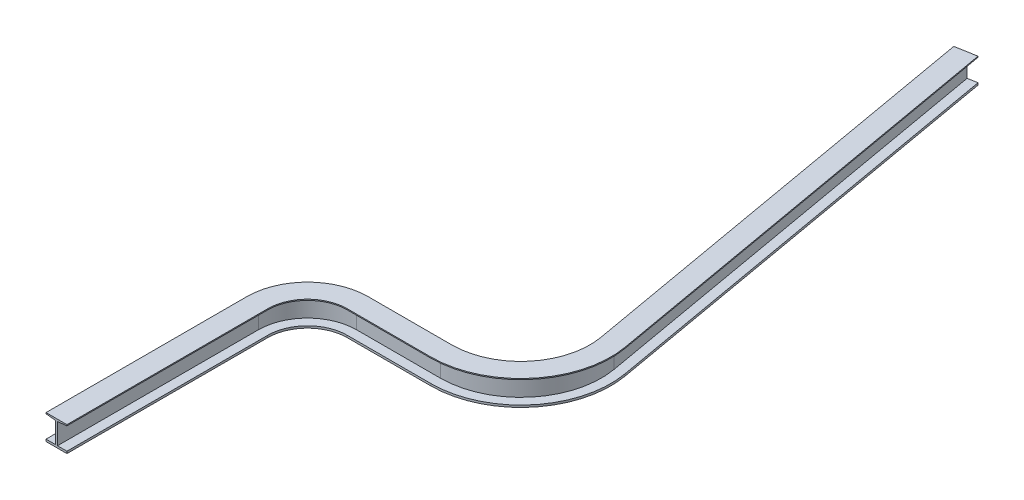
ISO-10303-21;
HEADER;
FILE_DESCRIPTION(('STEP AP214'),'2;1');
FILE_NAME('part.step','',(''),(''),'','','');
FILE_SCHEMA(('AUTOMOTIVE_DESIGN { 1 0 10303 214 1 1 1 1 }'));
ENDSEC;
DATA;
#1=APPLICATION_CONTEXT('core data for automotive mechanical design processes');
#2=APPLICATION_PROTOCOL_DEFINITION('international standard','automotive_design',2000,#1);
#3=PRODUCT_CONTEXT('',#1,'mechanical');
#4=PRODUCT('Part','Part','',(#3));
#5=PRODUCT_RELATED_PRODUCT_CATEGORY('part','',(#4));
#6=PRODUCT_DEFINITION_FORMATION('','',#4);
#7=PRODUCT_DEFINITION_CONTEXT('part definition',#1,'design');
#8=PRODUCT_DEFINITION('design','',#6,#7);
#9=PRODUCT_DEFINITION_SHAPE('','',#8);
#10=(LENGTH_UNIT() NAMED_UNIT(*) SI_UNIT(.MILLI.,.METRE.));
#11=(NAMED_UNIT(*) PLANE_ANGLE_UNIT() SI_UNIT($,.RADIAN.));
#12=(NAMED_UNIT(*) SI_UNIT($,.STERADIAN.) SOLID_ANGLE_UNIT());
#13=UNCERTAINTY_MEASURE_WITH_UNIT(LENGTH_MEASURE(1.E-05),#10,'distance_accuracy_value','');
#14=(GEOMETRIC_REPRESENTATION_CONTEXT(3) GLOBAL_UNCERTAINTY_ASSIGNED_CONTEXT((#13)) GLOBAL_UNIT_ASSIGNED_CONTEXT((#10,
#11,#12)) REPRESENTATION_CONTEXT('',''));
#15=CARTESIAN_POINT('',(0.,0.,0.));
#16=DIRECTION('',(0.,0.,1.));
#17=DIRECTION('',(1.,0.,0.));
#18=AXIS2_PLACEMENT_3D('',#15,#16,#17);
#19=CARTESIAN_POINT('',(675.301756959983,50.8,-1050.71463491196));
#20=DIRECTION('',(-0.984807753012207,0.,0.173648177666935));
#21=DIRECTION('',(0.173648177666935,0.,0.984807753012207));
#22=AXIS2_PLACEMENT_3D('',#19,#20,#21);
#23=PLANE('',#22);
#24=DIRECTION('',(0.,1.,0.));
#25=VECTOR('',#24,1.);
#26=CARTESIAN_POINT('',(675.301756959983,50.8,-1050.71463491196));
#27=LINE('',#26,#25);
#28=CARTESIAN_POINT('',(675.301756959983,47.625,-1050.71463491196));
#29=VERTEX_POINT('',#28);
#30=CARTESIAN_POINT('',(675.301756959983,50.8,-1050.71463491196));
#31=VERTEX_POINT('',#30);
#32=EDGE_CURVE('E504',#29,#31,#27,.T.);
#33=ORIENTED_EDGE('',*,*,#32,.F.);
#34=DIRECTION('',(-0.173648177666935,0.,-0.984807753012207));
#35=VECTOR('',#34,1.);
#36=CARTESIAN_POINT('',(675.301756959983,47.625,-1050.71463491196));
#37=LINE('',#36,#35);
#38=CARTESIAN_POINT('',(445.947243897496,47.625,-2351.44871509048));
#39=VERTEX_POINT('',#38);
#40=EDGE_CURVE('E592',#29,#39,#37,.T.);
#41=ORIENTED_EDGE('',*,*,#40,.T.);
#42=DIRECTION('',(0.,1.,0.));
#43=VECTOR('',#42,1.);
#44=CARTESIAN_POINT('',(445.947243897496,50.8,-2351.44871509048));
#45=LINE('',#44,#43);
#46=CARTESIAN_POINT('',(445.947243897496,50.8,-2351.44871509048));
#47=VERTEX_POINT('',#46);
#48=EDGE_CURVE('E54',#39,#47,#45,.T.);
#49=ORIENTED_EDGE('',*,*,#48,.T.);
#50=DIRECTION('',(-0.173648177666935,0.,-0.984807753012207));
#51=VECTOR('',#50,1.);
#52=CARTESIAN_POINT('',(675.301756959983,50.8,-1050.71463491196));
#53=LINE('',#52,#51);
#54=EDGE_CURVE('E39',#31,#47,#53,.T.);
#55=ORIENTED_EDGE('',*,*,#54,.F.);
#56=EDGE_LOOP('',(#33,#41,#49,#55));
#57=FACE_BOUND('',#56,.T.);
#58=ADVANCED_FACE('F32',(#57),#23,.F.);
#59=CARTESIAN_POINT('',(675.301756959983,47.625,-1050.71463491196));
#60=DIRECTION('',(-0.108753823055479,0.993883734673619,0.0191762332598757));
#61=DIRECTION('',(-0.994066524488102,-0.108773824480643,0.));
#62=AXIS2_PLACEMENT_3D('',#59,#60,#61);
#63=PLANE('',#62);
#64=DIRECTION('',(0.978784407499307,0.110431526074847,-0.172586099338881));
#65=VECTOR('',#64,1.);
#66=CARTESIAN_POINT('',(675.301756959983,47.625,-1050.71463491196));
#67=LINE('',#66,#65);
#68=CARTESIAN_POINT('',(647.160875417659,44.45,-1045.75263823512));
#69=VERTEX_POINT('',#68);
#70=EDGE_CURVE('E501',#69,#29,#67,.T.);
#71=ORIENTED_EDGE('',*,*,#70,.F.);
#72=DIRECTION('',(-0.173648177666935,0.,-0.984807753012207));
#73=VECTOR('',#72,1.);
#74=CARTESIAN_POINT('',(647.160875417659,44.45,-1045.75263823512));
#75=LINE('',#74,#73);
#76=CARTESIAN_POINT('',(417.806362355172,44.45,-2346.48671841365));
#77=VERTEX_POINT('',#76);
#78=EDGE_CURVE('E589',#69,#77,#75,.T.);
#79=ORIENTED_EDGE('',*,*,#78,.T.);
#80=DIRECTION('',(0.978784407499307,0.110431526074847,-0.172586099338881));
#81=VECTOR('',#80,1.);
#82=CARTESIAN_POINT('',(445.947243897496,47.625,-2351.44871509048));
#83=LINE('',#82,#81);
#84=EDGE_CURVE('E561',#77,#39,#83,.T.);
#85=ORIENTED_EDGE('',*,*,#84,.T.);
#86=ORIENTED_EDGE('',*,*,#40,.F.);
#87=EDGE_LOOP('',(#71,#79,#85,#86));
#88=FACE_BOUND('',#87,.T.);
#89=ADVANCED_FACE('F604',(#88),#63,.F.);
#90=CARTESIAN_POINT('',(647.160875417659,44.45,-1045.75263823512));
#91=DIRECTION('',(-0.984807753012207,0.,0.173648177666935));
#92=DIRECTION('',(0.173648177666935,0.,0.984807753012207));
#93=AXIS2_PLACEMENT_3D('',#90,#91,#92);
#94=PLANE('',#93);
#95=DIRECTION('',(0.,1.,0.));
#96=VECTOR('',#95,1.);
#97=CARTESIAN_POINT('',(647.160875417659,44.45,-1045.75263823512));
#98=LINE('',#97,#96);
#99=CARTESIAN_POINT('',(647.160875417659,-19.05,-1045.75263823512));
#100=VERTEX_POINT('',#99);
#101=EDGE_CURVE('E498',#100,#69,#98,.T.);
#102=ORIENTED_EDGE('',*,*,#101,.F.);
#103=DIRECTION('',(-0.173648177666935,0.,-0.984807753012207));
#104=VECTOR('',#103,1.);
#105=CARTESIAN_POINT('',(647.160875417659,-19.05,-1045.75263823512));
#106=LINE('',#105,#104);
#107=CARTESIAN_POINT('',(417.806362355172,-19.05,-2346.48671841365));
#108=VERTEX_POINT('',#107);
#109=EDGE_CURVE('E586',#100,#108,#106,.T.);
#110=ORIENTED_EDGE('',*,*,#109,.T.);
#111=DIRECTION('',(0.,1.,0.));
#112=VECTOR('',#111,1.);
#113=CARTESIAN_POINT('',(417.806362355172,44.45,-2346.48671841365));
#114=LINE('',#113,#112);
#115=EDGE_CURVE('E559',#108,#77,#114,.T.);
#116=ORIENTED_EDGE('',*,*,#115,.T.);
#117=ORIENTED_EDGE('',*,*,#78,.F.);
#118=EDGE_LOOP('',(#102,#110,#116,#117));
#119=FACE_BOUND('',#118,.T.);
#120=ADVANCED_FACE('F610',(#119),#94,.F.);
#121=CARTESIAN_POINT('',(675.301756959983,-19.05,-1050.71463491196));
#122=DIRECTION('',(-0.984807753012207,0.,0.173648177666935));
#123=DIRECTION('',(0.173648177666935,0.,0.984807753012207));
#124=AXIS2_PLACEMENT_3D('',#121,#122,#123);
#125=PLANE('',#124);
#126=DIRECTION('',(0.,1.,0.));
#127=VECTOR('',#126,1.);
#128=CARTESIAN_POINT('',(675.301756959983,-19.05,-1050.71463491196));
#129=LINE('',#128,#127);
#130=CARTESIAN_POINT('',(675.301756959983,-25.4,-1050.71463491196));
#131=VERTEX_POINT('',#130);
#132=CARTESIAN_POINT('',(675.301756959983,-19.05,-1050.71463491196));
#133=VERTEX_POINT('',#132);
#134=EDGE_CURVE('E495',#131,#133,#129,.T.);
#135=ORIENTED_EDGE('',*,*,#134,.F.);
#136=DIRECTION('',(-0.173648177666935,0.,-0.984807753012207));
#137=VECTOR('',#136,1.);
#138=CARTESIAN_POINT('',(675.301756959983,-25.4,-1050.71463491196));
#139=LINE('',#138,#137);
#140=CARTESIAN_POINT('',(445.947243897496,-25.4,-2351.44871509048));
#141=VERTEX_POINT('',#140);
#142=EDGE_CURVE('E580',#131,#141,#139,.T.);
#143=ORIENTED_EDGE('',*,*,#142,.T.);
#144=DIRECTION('',(0.,1.,0.));
#145=VECTOR('',#144,1.);
#146=CARTESIAN_POINT('',(445.947243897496,-19.05,-2351.44871509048));
#147=LINE('',#146,#145);
#148=CARTESIAN_POINT('',(445.947243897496,-19.05,-2351.44871509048));
#149=VERTEX_POINT('',#148);
#150=EDGE_CURVE('E555',#141,#149,#147,.T.);
#151=ORIENTED_EDGE('',*,*,#150,.T.);
#152=DIRECTION('',(-0.173648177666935,0.,-0.984807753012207));
#153=VECTOR('',#152,1.);
#154=CARTESIAN_POINT('',(675.301756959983,-19.05,-1050.71463491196));
#155=LINE('',#154,#153);
#156=EDGE_CURVE('E583',#133,#149,#155,.T.);
#157=ORIENTED_EDGE('',*,*,#156,.F.);
#158=EDGE_LOOP('',(#135,#143,#151,#157));
#159=FACE_BOUND('',#158,.T.);
#160=ADVANCED_FACE('F662',(#159),#125,.F.);
#161=CARTESIAN_POINT('',(612.766464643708,-25.4,-1039.68797563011));
#162=DIRECTION('',(0.984807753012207,0.,-0.173648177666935));
#163=DIRECTION('',(-0.173648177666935,0.,-0.984807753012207));
#164=AXIS2_PLACEMENT_3D('',#161,#162,#163);
#165=PLANE('',#164);
#166=DIRECTION('',(0.,-1.,0.));
#167=VECTOR('',#166,1.);
#168=CARTESIAN_POINT('',(612.766464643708,-25.4,-1039.68797563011));
#169=LINE('',#168,#167);
#170=CARTESIAN_POINT('',(612.766464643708,-19.05,-1039.68797563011));
#171=VERTEX_POINT('',#170);
#172=CARTESIAN_POINT('',(612.766464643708,-25.4,-1039.68797563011));
#173=VERTEX_POINT('',#172);
#174=EDGE_CURVE('E492',#171,#173,#169,.T.);
#175=ORIENTED_EDGE('',*,*,#174,.F.);
#176=DIRECTION('',(-0.173648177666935,0.,-0.984807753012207));
#177=VECTOR('',#176,1.);
#178=CARTESIAN_POINT('',(612.766464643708,-19.05,-1039.68797563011));
#179=LINE('',#178,#177);
#180=CARTESIAN_POINT('',(383.411951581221,-19.05,-2340.42205580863));
#181=VERTEX_POINT('',#180);
#182=EDGE_CURVE('E574',#171,#181,#179,.T.);
#183=ORIENTED_EDGE('',*,*,#182,.T.);
#184=DIRECTION('',(0.,-1.,0.));
#185=VECTOR('',#184,1.);
#186=CARTESIAN_POINT('',(383.411951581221,-25.4,-2340.42205580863));
#187=LINE('',#186,#185);
#188=CARTESIAN_POINT('',(383.411951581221,-25.4,-2340.42205580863));
#189=VERTEX_POINT('',#188);
#190=EDGE_CURVE('E551',#181,#189,#187,.T.);
#191=ORIENTED_EDGE('',*,*,#190,.T.);
#192=DIRECTION('',(-0.173648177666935,0.,-0.984807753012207));
#193=VECTOR('',#192,1.);
#194=CARTESIAN_POINT('',(612.766464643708,-25.4,-1039.68797563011));
#195=LINE('',#194,#193);
#196=EDGE_CURVE('E577',#173,#189,#195,.T.);
#197=ORIENTED_EDGE('',*,*,#196,.F.);
#198=EDGE_LOOP('',(#175,#183,#191,#197));
#199=FACE_BOUND('',#198,.T.);
#200=ADVANCED_FACE('F669',(#199),#165,.F.);
#201=CARTESIAN_POINT('',(640.907346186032,-19.05,-1044.64997230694));
#202=DIRECTION('',(0.984807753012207,0.,-0.173648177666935));
#203=DIRECTION('',(-0.173648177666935,0.,-0.984807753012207));
#204=AXIS2_PLACEMENT_3D('',#201,#202,#203);
#205=PLANE('',#204);
#206=DIRECTION('',(0.,-1.,0.));
#207=VECTOR('',#206,1.);
#208=CARTESIAN_POINT('',(640.907346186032,-19.05,-1044.64997230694));
#209=LINE('',#208,#207);
#210=CARTESIAN_POINT('',(640.907346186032,44.45,-1044.64997230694));
#211=VERTEX_POINT('',#210);
#212=CARTESIAN_POINT('',(640.907346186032,-19.05,-1044.64997230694));
#213=VERTEX_POINT('',#212);
#214=EDGE_CURVE('E489',#211,#213,#209,.T.);
#215=ORIENTED_EDGE('',*,*,#214,.F.);
#216=DIRECTION('',(-0.173648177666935,0.,-0.984807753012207));
#217=VECTOR('',#216,1.);
#218=CARTESIAN_POINT('',(640.907346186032,44.45,-1044.64997230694));
#219=LINE('',#218,#217);
#220=CARTESIAN_POINT('',(411.552833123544,44.45,-2345.38405248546));
#221=VERTEX_POINT('',#220);
#222=EDGE_CURVE('E568',#211,#221,#219,.T.);
#223=ORIENTED_EDGE('',*,*,#222,.T.);
#224=DIRECTION('',(0.,-1.,0.));
#225=VECTOR('',#224,1.);
#226=CARTESIAN_POINT('',(411.552833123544,-19.05,-2345.38405248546));
#227=LINE('',#226,#225);
#228=CARTESIAN_POINT('',(411.552833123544,-19.05,-2345.38405248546));
#229=VERTEX_POINT('',#228);
#230=EDGE_CURVE('E547',#221,#229,#227,.T.);
#231=ORIENTED_EDGE('',*,*,#230,.T.);
#232=DIRECTION('',(-0.173648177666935,0.,-0.984807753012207));
#233=VECTOR('',#232,1.);
#234=CARTESIAN_POINT('',(640.907346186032,-19.05,-1044.64997230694));
#235=LINE('',#234,#233);
#236=EDGE_CURVE('E571',#213,#229,#235,.T.);
#237=ORIENTED_EDGE('',*,*,#236,.F.);
#238=EDGE_LOOP('',(#215,#223,#231,#237));
#239=FACE_BOUND('',#238,.T.);
#240=ADVANCED_FACE('F680',(#239),#205,.F.);
#241=CARTESIAN_POINT('',(640.907346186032,44.45,-1044.64997230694));
#242=DIRECTION('',(0.108753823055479,0.993883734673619,-0.0191762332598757));
#243=DIRECTION('',(-0.994066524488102,0.108773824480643,0.));
#244=AXIS2_PLACEMENT_3D('',#241,#242,#243);
#245=PLANE('',#244);
#246=DIRECTION('',(0.978784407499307,-0.110431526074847,-0.172586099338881));
#247=VECTOR('',#246,1.);
#248=CARTESIAN_POINT('',(640.907346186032,44.45,-1044.64997230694));
#249=LINE('',#248,#247);
#250=CARTESIAN_POINT('',(612.766464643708,47.625,-1039.68797563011));
#251=VERTEX_POINT('',#250);
#252=EDGE_CURVE('E486',#251,#211,#249,.T.);
#253=ORIENTED_EDGE('',*,*,#252,.F.);
#254=DIRECTION('',(-0.173648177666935,0.,-0.984807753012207));
#255=VECTOR('',#254,1.);
#256=CARTESIAN_POINT('',(612.766464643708,47.625,-1039.68797563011));
#257=LINE('',#256,#255);
#258=CARTESIAN_POINT('',(383.411951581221,47.625,-2340.42205580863));
#259=VERTEX_POINT('',#258);
#260=EDGE_CURVE('E565',#251,#259,#257,.T.);
#261=ORIENTED_EDGE('',*,*,#260,.T.);
#262=DIRECTION('',(0.978784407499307,-0.110431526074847,-0.172586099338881));
#263=VECTOR('',#262,1.);
#264=CARTESIAN_POINT('',(411.552833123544,44.45,-2345.38405248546));
#265=LINE('',#264,#263);
#266=EDGE_CURVE('E545',#259,#221,#265,.T.);
#267=ORIENTED_EDGE('',*,*,#266,.T.);
#268=ORIENTED_EDGE('',*,*,#222,.F.);
#269=EDGE_LOOP('',(#253,#261,#267,#268));
#270=FACE_BOUND('',#269,.T.);
#271=ADVANCED_FACE('F683',(#270),#245,.F.);
#272=CARTESIAN_POINT('',(612.766464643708,47.625,-1039.68797563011));
#273=DIRECTION('',(0.984807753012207,0.,-0.173648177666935));
#274=DIRECTION('',(-0.173648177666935,0.,-0.984807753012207));
#275=AXIS2_PLACEMENT_3D('',#272,#273,#274);
#276=PLANE('',#275);
#277=DIRECTION('',(0.,-1.,0.));
#278=VECTOR('',#277,1.);
#279=CARTESIAN_POINT('',(612.766464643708,47.625,-1039.68797563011));
#280=LINE('',#279,#278);
#281=CARTESIAN_POINT('',(612.766464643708,50.8,-1039.68797563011));
#282=VERTEX_POINT('',#281);
#283=EDGE_CURVE('E483',#282,#251,#280,.T.);
#284=ORIENTED_EDGE('',*,*,#283,.F.);
#285=DIRECTION('',(-0.173648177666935,0.,-0.984807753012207));
#286=VECTOR('',#285,1.);
#287=CARTESIAN_POINT('',(612.766464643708,50.8,-1039.68797563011));
#288=LINE('',#287,#286);
#289=CARTESIAN_POINT('',(383.411951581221,50.8,-2340.42205580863));
#290=VERTEX_POINT('',#289);
#291=EDGE_CURVE('E11',#282,#290,#288,.T.);
#292=ORIENTED_EDGE('',*,*,#291,.T.);
#293=DIRECTION('',(0.,-1.,0.));
#294=VECTOR('',#293,1.);
#295=CARTESIAN_POINT('',(383.411951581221,47.625,-2340.42205580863));
#296=LINE('',#295,#294);
#297=EDGE_CURVE('E543',#290,#259,#296,.T.);
#298=ORIENTED_EDGE('',*,*,#297,.T.);
#299=ORIENTED_EDGE('',*,*,#260,.F.);
#300=EDGE_LOOP('',(#284,#292,#298,#299));
#301=FACE_BOUND('',#300,.T.);
#302=ADVANCED_FACE('F620',(#301),#276,.F.);
#303=CARTESIAN_POINT('',(406.4,0.,-1003.3));
#304=DIRECTION('',(0.,1.,0.));
#305=DIRECTION('',(0.,0.,1.));
#306=AXIS2_PLACEMENT_3D('',#303,#304,#305);
#307=CYLINDRICAL_SURFACE('',#306,273.05);
#308=DIRECTION('',(0.,1.,0.));
#309=VECTOR('',#308,1.);
#310=CARTESIAN_POINT('',(406.4,50.8,-730.25));
#311=LINE('',#310,#309);
#312=CARTESIAN_POINT('',(406.4,47.625,-730.25));
#313=VERTEX_POINT('',#312);
#314=CARTESIAN_POINT('',(406.4,50.8,-730.25));
#315=VERTEX_POINT('',#314);
#316=EDGE_CURVE('E444',#313,#315,#311,.T.);
#317=ORIENTED_EDGE('',*,*,#316,.F.);
#318=CARTESIAN_POINT('',(406.4,47.625,-1003.3));
#319=DIRECTION('',(0.,1.,0.));
#320=DIRECTION('',(0.,0.,1.));
#321=AXIS2_PLACEMENT_3D('',#318,#319,#320);
#322=CIRCLE('',#321,273.05);
#323=EDGE_CURVE('E534',#313,#29,#322,.T.);
#324=ORIENTED_EDGE('',*,*,#323,.T.);
#325=ORIENTED_EDGE('',*,*,#32,.T.);
#326=CARTESIAN_POINT('',(406.4,50.8,-1003.3));
#327=DIRECTION('',(0.,1.,0.));
#328=DIRECTION('',(0.,0.,1.));
#329=AXIS2_PLACEMENT_3D('',#326,#327,#328);
#330=CIRCLE('',#329,273.05);
#331=EDGE_CURVE('E537',#315,#31,#330,.T.);
#332=ORIENTED_EDGE('',*,*,#331,.F.);
#333=EDGE_LOOP('',(#317,#324,#325,#332));
#334=FACE_BOUND('',#333,.T.);
#335=ADVANCED_FACE('F598',(#334),#307,.T.);
#336=CARTESIAN_POINT('',(406.4,44.45,-1003.3));
#337=DIRECTION('',(0.,1.,0.));
#338=DIRECTION('',(0.,0.,1.));
#339=AXIS2_PLACEMENT_3D('',#336,#337,#338);
#340=CONICAL_SURFACE('',#339,244.475,1.460139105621);
#341=DIRECTION('',(0.,0.110431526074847,0.993883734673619));
#342=VECTOR('',#341,1.);
#343=CARTESIAN_POINT('',(406.4,47.625,-730.25));
#344=LINE('',#343,#342);
#345=CARTESIAN_POINT('',(406.4,44.45,-758.825));
#346=VERTEX_POINT('',#345);
#347=EDGE_CURVE('E441',#346,#313,#344,.T.);
#348=ORIENTED_EDGE('',*,*,#347,.F.);
#349=CARTESIAN_POINT('',(406.4,44.45,-1003.3));
#350=DIRECTION('',(0.,1.,0.));
#351=DIRECTION('',(0.,0.,1.));
#352=AXIS2_PLACEMENT_3D('',#349,#350,#351);
#353=CIRCLE('',#352,244.475);
#354=EDGE_CURVE('E531',#346,#69,#353,.T.);
#355=ORIENTED_EDGE('',*,*,#354,.T.);
#356=ORIENTED_EDGE('',*,*,#70,.T.);
#357=ORIENTED_EDGE('',*,*,#323,.F.);
#358=EDGE_LOOP('',(#348,#355,#356,#357));
#359=FACE_BOUND('',#358,.T.);
#360=ADVANCED_FACE('F601',(#359),#340,.T.);
#361=CARTESIAN_POINT('',(406.4,0.,-1003.3));
#362=DIRECTION('',(0.,1.,0.));
#363=DIRECTION('',(0.,0.,1.));
#364=AXIS2_PLACEMENT_3D('',#361,#362,#363);
#365=CYLINDRICAL_SURFACE('',#364,244.475);
#366=DIRECTION('',(0.,1.,0.));
#367=VECTOR('',#366,1.);
#368=CARTESIAN_POINT('',(406.4,44.45,-758.825));
#369=LINE('',#368,#367);
#370=CARTESIAN_POINT('',(406.4,-19.05,-758.825));
#371=VERTEX_POINT('',#370);
#372=EDGE_CURVE('E438',#371,#346,#369,.T.);
#373=ORIENTED_EDGE('',*,*,#372,.F.);
#374=CARTESIAN_POINT('',(406.4,-19.05,-1003.3));
#375=DIRECTION('',(0.,1.,0.));
#376=DIRECTION('',(0.,0.,1.));
#377=AXIS2_PLACEMENT_3D('',#374,#375,#376);
#378=CIRCLE('',#377,244.475);
#379=EDGE_CURVE('E528',#371,#100,#378,.T.);
#380=ORIENTED_EDGE('',*,*,#379,.T.);
#381=ORIENTED_EDGE('',*,*,#101,.T.);
#382=ORIENTED_EDGE('',*,*,#354,.F.);
#383=EDGE_LOOP('',(#373,#380,#381,#382));
#384=FACE_BOUND('',#383,.T.);
#385=ADVANCED_FACE('F608',(#384),#365,.T.);
#386=CARTESIAN_POINT('',(406.4,0.,-1003.3));
#387=DIRECTION('',(0.,1.,0.));
#388=DIRECTION('',(0.,0.,1.));
#389=AXIS2_PLACEMENT_3D('',#386,#387,#388);
#390=CYLINDRICAL_SURFACE('',#389,273.05);
#391=DIRECTION('',(0.,1.,0.));
#392=VECTOR('',#391,1.);
#393=CARTESIAN_POINT('',(406.4,-19.05,-730.25));
#394=LINE('',#393,#392);
#395=CARTESIAN_POINT('',(406.4,-25.4,-730.25));
#396=VERTEX_POINT('',#395);
#397=CARTESIAN_POINT('',(406.4,-19.05,-730.25));
#398=VERTEX_POINT('',#397);
#399=EDGE_CURVE('E435',#396,#398,#394,.T.);
#400=ORIENTED_EDGE('',*,*,#399,.F.);
#401=CARTESIAN_POINT('',(406.4,-25.4,-1003.3));
#402=DIRECTION('',(0.,1.,0.));
#403=DIRECTION('',(0.,0.,1.));
#404=AXIS2_PLACEMENT_3D('',#401,#402,#403);
#405=CIRCLE('',#404,273.05);
#406=EDGE_CURVE('E522',#396,#131,#405,.T.);
#407=ORIENTED_EDGE('',*,*,#406,.T.);
#408=ORIENTED_EDGE('',*,*,#134,.T.);
#409=CARTESIAN_POINT('',(406.4,-19.05,-1003.3));
#410=DIRECTION('',(0.,1.,0.));
#411=DIRECTION('',(0.,0.,1.));
#412=AXIS2_PLACEMENT_3D('',#409,#410,#411);
#413=CIRCLE('',#412,273.05);
#414=EDGE_CURVE('E525',#398,#133,#413,.T.);
#415=ORIENTED_EDGE('',*,*,#414,.F.);
#416=EDGE_LOOP('',(#400,#407,#408,#415));
#417=FACE_BOUND('',#416,.T.);
#418=ADVANCED_FACE('F751',(#417),#390,.T.);
#419=CARTESIAN_POINT('',(406.4,0.,-1003.3));
#420=DIRECTION('',(0.,1.,0.));
#421=DIRECTION('',(0.,0.,1.));
#422=AXIS2_PLACEMENT_3D('',#419,#420,#421);
#423=CYLINDRICAL_SURFACE('',#422,209.55);
#424=DIRECTION('',(0.,-1.,0.));
#425=VECTOR('',#424,1.);
#426=CARTESIAN_POINT('',(406.4,-25.4,-793.75));
#427=LINE('',#426,#425);
#428=CARTESIAN_POINT('',(406.4,-19.05,-793.75));
#429=VERTEX_POINT('',#428);
#430=CARTESIAN_POINT('',(406.4,-25.4,-793.75));
#431=VERTEX_POINT('',#430);
#432=EDGE_CURVE('E432',#429,#431,#427,.T.);
#433=ORIENTED_EDGE('',*,*,#432,.F.);
#434=CARTESIAN_POINT('',(406.4,-19.05,-1003.3));
#435=DIRECTION('',(0.,1.,0.));
#436=DIRECTION('',(0.,0.,1.));
#437=AXIS2_PLACEMENT_3D('',#434,#435,#436);
#438=CIRCLE('',#437,209.55);
#439=EDGE_CURVE('E516',#429,#171,#438,.T.);
#440=ORIENTED_EDGE('',*,*,#439,.T.);
#441=ORIENTED_EDGE('',*,*,#174,.T.);
#442=CARTESIAN_POINT('',(406.4,-25.4,-1003.3));
#443=DIRECTION('',(0.,1.,0.));
#444=DIRECTION('',(0.,0.,1.));
#445=AXIS2_PLACEMENT_3D('',#442,#443,#444);
#446=CIRCLE('',#445,209.55);
#447=EDGE_CURVE('E519',#431,#173,#446,.T.);
#448=ORIENTED_EDGE('',*,*,#447,.F.);
#449=EDGE_LOOP('',(#433,#440,#441,#448));
#450=FACE_BOUND('',#449,.T.);
#451=ADVANCED_FACE('F672',(#450),#423,.F.);
#452=CARTESIAN_POINT('',(406.4,0.,-1003.3));
#453=DIRECTION('',(0.,1.,0.));
#454=DIRECTION('',(0.,0.,1.));
#455=AXIS2_PLACEMENT_3D('',#452,#453,#454);
#456=CYLINDRICAL_SURFACE('',#455,238.125);
#457=DIRECTION('',(0.,-1.,0.));
#458=VECTOR('',#457,1.);
#459=CARTESIAN_POINT('',(406.4,-19.05,-765.175));
#460=LINE('',#459,#458);
#461=CARTESIAN_POINT('',(406.4,44.45,-765.175));
#462=VERTEX_POINT('',#461);
#463=CARTESIAN_POINT('',(406.4,-19.05,-765.175));
#464=VERTEX_POINT('',#463);
#465=EDGE_CURVE('E429',#462,#464,#460,.T.);
#466=ORIENTED_EDGE('',*,*,#465,.F.);
#467=CARTESIAN_POINT('',(406.4,44.45,-1003.3));
#468=DIRECTION('',(0.,1.,0.));
#469=DIRECTION('',(0.,0.,1.));
#470=AXIS2_PLACEMENT_3D('',#467,#468,#469);
#471=CIRCLE('',#470,238.125);
#472=EDGE_CURVE('E510',#462,#211,#471,.T.);
#473=ORIENTED_EDGE('',*,*,#472,.T.);
#474=ORIENTED_EDGE('',*,*,#214,.T.);
#475=CARTESIAN_POINT('',(406.4,-19.05,-1003.3));
#476=DIRECTION('',(0.,1.,0.));
#477=DIRECTION('',(0.,0.,1.));
#478=AXIS2_PLACEMENT_3D('',#475,#476,#477);
#479=CIRCLE('',#478,238.125);
#480=EDGE_CURVE('E513',#464,#213,#479,.T.);
#481=ORIENTED_EDGE('',*,*,#480,.F.);
#482=EDGE_LOOP('',(#466,#473,#474,#481));
#483=FACE_BOUND('',#482,.T.);
#484=ADVANCED_FACE('F757',(#483),#456,.F.);
#485=CARTESIAN_POINT('',(406.4,47.625,-1003.3));
#486=DIRECTION('',(0.,-1.,0.));
#487=DIRECTION('',(0.,0.,-1.));
#488=AXIS2_PLACEMENT_3D('',#485,#486,#487);
#489=CONICAL_SURFACE('',#488,209.55,1.460139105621);
#490=DIRECTION('',(0.,-0.110431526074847,0.993883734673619));
#491=VECTOR('',#490,1.);
#492=CARTESIAN_POINT('',(406.4,44.45,-765.175));
#493=LINE('',#492,#491);
#494=CARTESIAN_POINT('',(406.4,47.625,-793.75));
#495=VERTEX_POINT('',#494);
#496=EDGE_CURVE('E426',#495,#462,#493,.T.);
#497=ORIENTED_EDGE('',*,*,#496,.F.);
#498=CARTESIAN_POINT('',(406.4,47.625,-1003.3));
#499=DIRECTION('',(0.,1.,0.));
#500=DIRECTION('',(0.,0.,1.));
#501=AXIS2_PLACEMENT_3D('',#498,#499,#500);
#502=CIRCLE('',#501,209.55);
#503=EDGE_CURVE('E507',#495,#251,#502,.T.);
#504=ORIENTED_EDGE('',*,*,#503,.T.);
#505=ORIENTED_EDGE('',*,*,#252,.T.);
#506=ORIENTED_EDGE('',*,*,#472,.F.);
#507=EDGE_LOOP('',(#497,#504,#505,#506));
#508=FACE_BOUND('',#507,.T.);
#509=ADVANCED_FACE('F685',(#508),#489,.F.);
#510=CARTESIAN_POINT('',(406.4,0.,-1003.3));
#511=DIRECTION('',(0.,1.,0.));
#512=DIRECTION('',(0.,0.,1.));
#513=AXIS2_PLACEMENT_3D('',#510,#511,#512);
#514=CYLINDRICAL_SURFACE('',#513,209.55);
#515=DIRECTION('',(0.,-1.,0.));
#516=VECTOR('',#515,1.);
#517=CARTESIAN_POINT('',(406.4,47.625,-793.75));
#518=LINE('',#517,#516);
#519=CARTESIAN_POINT('',(406.4,50.8,-793.75));
#520=VERTEX_POINT('',#519);
#521=EDGE_CURVE('E423',#520,#495,#518,.T.);
#522=ORIENTED_EDGE('',*,*,#521,.F.);
#523=CARTESIAN_POINT('',(406.4,50.8,-1003.3));
#524=DIRECTION('',(0.,1.,0.));
#525=DIRECTION('',(0.,0.,1.));
#526=AXIS2_PLACEMENT_3D('',#523,#524,#525);
#527=CIRCLE('',#526,209.55);
#528=EDGE_CURVE('E540',#520,#282,#527,.T.);
#529=ORIENTED_EDGE('',*,*,#528,.T.);
#530=ORIENTED_EDGE('',*,*,#283,.T.);
#531=ORIENTED_EDGE('',*,*,#503,.F.);
#532=EDGE_LOOP('',(#522,#529,#530,#531));
#533=FACE_BOUND('',#532,.T.);
#534=ADVANCED_FACE('F623',(#533),#514,.F.);
#535=CARTESIAN_POINT('',(152.4,50.8,-730.25));
#536=DIRECTION('',(0.,0.,-1.));
#537=DIRECTION('',(-1.,0.,0.));
#538=AXIS2_PLACEMENT_3D('',#535,#536,#537);
#539=PLANE('',#538);
#540=DIRECTION('',(0.,1.,0.));
#541=VECTOR('',#540,1.);
#542=CARTESIAN_POINT('',(152.4,50.8,-730.25));
#543=LINE('',#542,#541);
#544=CARTESIAN_POINT('',(152.4,47.625,-730.25));
#545=VERTEX_POINT('',#544);
#546=CARTESIAN_POINT('',(152.4,50.8,-730.25));
#547=VERTEX_POINT('',#546);
#548=EDGE_CURVE('E278',#545,#547,#543,.T.);
#549=ORIENTED_EDGE('',*,*,#548,.F.);
#550=DIRECTION('',(1.,0.,0.));
#551=VECTOR('',#550,1.);
#552=CARTESIAN_POINT('',(152.4,47.625,-730.25));
#553=LINE('',#552,#551);
#554=EDGE_CURVE('E474',#545,#313,#553,.T.);
#555=ORIENTED_EDGE('',*,*,#554,.T.);
#556=ORIENTED_EDGE('',*,*,#316,.T.);
#557=DIRECTION('',(1.,0.,0.));
#558=VECTOR('',#557,1.);
#559=CARTESIAN_POINT('',(152.4,50.8,-730.25));
#560=LINE('',#559,#558);
#561=EDGE_CURVE('E477',#547,#315,#560,.T.);
#562=ORIENTED_EDGE('',*,*,#561,.F.);
#563=EDGE_LOOP('',(#549,#555,#556,#562));
#564=FACE_BOUND('',#563,.T.);
#565=ADVANCED_FACE('F641',(#564),#539,.F.);
#566=CARTESIAN_POINT('',(152.4,47.625,-730.25));
#567=DIRECTION('',(0.,0.993883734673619,-0.110431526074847));
#568=DIRECTION('',(0.,0.110431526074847,0.993883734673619));
#569=AXIS2_PLACEMENT_3D('',#566,#567,#568);
#570=PLANE('',#569);
#571=DIRECTION('',(0.,0.110431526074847,0.993883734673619));
#572=VECTOR('',#571,1.);
#573=CARTESIAN_POINT('',(152.4,47.625,-730.25));
#574=LINE('',#573,#572);
#575=CARTESIAN_POINT('',(152.4,44.45,-758.825));
#576=VERTEX_POINT('',#575);
#577=EDGE_CURVE('E388',#576,#545,#574,.T.);
#578=ORIENTED_EDGE('',*,*,#577,.F.);
#579=DIRECTION('',(1.,0.,0.));
#580=VECTOR('',#579,1.);
#581=CARTESIAN_POINT('',(152.4,44.45,-758.825));
#582=LINE('',#581,#580);
#583=EDGE_CURVE('E471',#576,#346,#582,.T.);
#584=ORIENTED_EDGE('',*,*,#583,.T.);
#585=ORIENTED_EDGE('',*,*,#347,.T.);
#586=ORIENTED_EDGE('',*,*,#554,.F.);
#587=EDGE_LOOP('',(#578,#584,#585,#586));
#588=FACE_BOUND('',#587,.T.);
#589=ADVANCED_FACE('F647',(#588),#570,.F.);
#590=CARTESIAN_POINT('',(152.4,44.45,-758.825));
#591=DIRECTION('',(0.,0.,-1.));
#592=DIRECTION('',(0.,1.,0.));
#593=AXIS2_PLACEMENT_3D('',#590,#591,#592);
#594=PLANE('',#593);
#595=DIRECTION('',(0.,1.,0.));
#596=VECTOR('',#595,1.);
#597=CARTESIAN_POINT('',(152.4,44.45,-758.825));
#598=LINE('',#597,#596);
#599=CARTESIAN_POINT('',(152.4,-19.05,-758.825));
#600=VERTEX_POINT('',#599);
#601=EDGE_CURVE('E385',#600,#576,#598,.T.);
#602=ORIENTED_EDGE('',*,*,#601,.F.);
#603=DIRECTION('',(1.,0.,0.));
#604=VECTOR('',#603,1.);
#605=CARTESIAN_POINT('',(152.4,-19.05,-758.825));
#606=LINE('',#605,#604);
#607=EDGE_CURVE('E468',#600,#371,#606,.T.);
#608=ORIENTED_EDGE('',*,*,#607,.T.);
#609=ORIENTED_EDGE('',*,*,#372,.T.);
#610=ORIENTED_EDGE('',*,*,#583,.F.);
#611=EDGE_LOOP('',(#602,#608,#609,#610));
#612=FACE_BOUND('',#611,.T.);
#613=ADVANCED_FACE('F653',(#612),#594,.F.);
#614=CARTESIAN_POINT('',(152.4,-19.05,-730.25));
#615=DIRECTION('',(0.,0.,-1.));
#616=DIRECTION('',(-1.,0.,0.));
#617=AXIS2_PLACEMENT_3D('',#614,#615,#616);
#618=PLANE('',#617);
#619=DIRECTION('',(0.,1.,0.));
#620=VECTOR('',#619,1.);
#621=CARTESIAN_POINT('',(152.4,-19.05,-730.25));
#622=LINE('',#621,#620);
#623=CARTESIAN_POINT('',(152.4,-25.4,-730.25));
#624=VERTEX_POINT('',#623);
#625=CARTESIAN_POINT('',(152.4,-19.05,-730.25));
#626=VERTEX_POINT('',#625);
#627=EDGE_CURVE('E382',#624,#626,#622,.T.);
#628=ORIENTED_EDGE('',*,*,#627,.F.);
#629=DIRECTION('',(1.,0.,0.));
#630=VECTOR('',#629,1.);
#631=CARTESIAN_POINT('',(152.4,-25.4,-730.25));
#632=LINE('',#631,#630);
#633=EDGE_CURVE('E462',#624,#396,#632,.T.);
#634=ORIENTED_EDGE('',*,*,#633,.T.);
#635=ORIENTED_EDGE('',*,*,#399,.T.);
#636=DIRECTION('',(1.,0.,0.));
#637=VECTOR('',#636,1.);
#638=CARTESIAN_POINT('',(152.4,-19.05,-730.25));
#639=LINE('',#638,#637);
#640=EDGE_CURVE('E465',#626,#398,#639,.T.);
#641=ORIENTED_EDGE('',*,*,#640,.F.);
#642=EDGE_LOOP('',(#628,#634,#635,#641));
#643=FACE_BOUND('',#642,.T.);
#644=ADVANCED_FACE('F771',(#643),#618,.F.);
#645=CARTESIAN_POINT('',(152.4,-25.4,-793.75));
#646=DIRECTION('',(0.,0.,1.));
#647=DIRECTION('',(0.,-1.,0.));
#648=AXIS2_PLACEMENT_3D('',#645,#646,#647);
#649=PLANE('',#648);
#650=DIRECTION('',(0.,-1.,0.));
#651=VECTOR('',#650,1.);
#652=CARTESIAN_POINT('',(152.4,-25.4,-793.75));
#653=LINE('',#652,#651);
#654=CARTESIAN_POINT('',(152.4,-19.05,-793.75));
#655=VERTEX_POINT('',#654);
#656=CARTESIAN_POINT('',(152.4,-25.4,-793.75));
#657=VERTEX_POINT('',#656);
#658=EDGE_CURVE('E379',#655,#657,#653,.T.);
#659=ORIENTED_EDGE('',*,*,#658,.F.);
#660=DIRECTION('',(1.,0.,0.));
#661=VECTOR('',#660,1.);
#662=CARTESIAN_POINT('',(152.4,-19.05,-793.75));
#663=LINE('',#662,#661);
#664=EDGE_CURVE('E456',#655,#429,#663,.T.);
#665=ORIENTED_EDGE('',*,*,#664,.T.);
#666=ORIENTED_EDGE('',*,*,#432,.T.);
#667=DIRECTION('',(1.,0.,0.));
#668=VECTOR('',#667,1.);
#669=CARTESIAN_POINT('',(152.4,-25.4,-793.75));
#670=LINE('',#669,#668);
#671=EDGE_CURVE('E459',#657,#431,#670,.T.);
#672=ORIENTED_EDGE('',*,*,#671,.F.);
#673=EDGE_LOOP('',(#659,#665,#666,#672));
#674=FACE_BOUND('',#673,.T.);
#675=ADVANCED_FACE('F774',(#674),#649,.F.);
#676=CARTESIAN_POINT('',(152.4,-19.05,-765.175));
#677=DIRECTION('',(0.,0.,1.));
#678=DIRECTION('',(0.,-1.,0.));
#679=AXIS2_PLACEMENT_3D('',#676,#677,#678);
#680=PLANE('',#679);
#681=DIRECTION('',(0.,-1.,0.));
#682=VECTOR('',#681,1.);
#683=CARTESIAN_POINT('',(152.4,-19.05,-765.175));
#684=LINE('',#683,#682);
#685=CARTESIAN_POINT('',(152.4,44.45,-765.175));
#686=VERTEX_POINT('',#685);
#687=CARTESIAN_POINT('',(152.4,-19.05,-765.175));
#688=VERTEX_POINT('',#687);
#689=EDGE_CURVE('E376',#686,#688,#684,.T.);
#690=ORIENTED_EDGE('',*,*,#689,.F.);
#691=DIRECTION('',(1.,0.,0.));
#692=VECTOR('',#691,1.);
#693=CARTESIAN_POINT('',(152.4,44.45,-765.175));
#694=LINE('',#693,#692);
#695=EDGE_CURVE('E450',#686,#462,#694,.T.);
#696=ORIENTED_EDGE('',*,*,#695,.T.);
#697=ORIENTED_EDGE('',*,*,#465,.T.);
#698=DIRECTION('',(1.,0.,0.));
#699=VECTOR('',#698,1.);
#700=CARTESIAN_POINT('',(152.4,-19.05,-765.175));
#701=LINE('',#700,#699);
#702=EDGE_CURVE('E453',#688,#464,#701,.T.);
#703=ORIENTED_EDGE('',*,*,#702,.F.);
#704=EDGE_LOOP('',(#690,#696,#697,#703));
#705=FACE_BOUND('',#704,.T.);
#706=ADVANCED_FACE('F691',(#705),#680,.F.);
#707=CARTESIAN_POINT('',(152.4,44.45,-765.175));
#708=DIRECTION('',(0.,0.993883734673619,0.110431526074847));
#709=DIRECTION('',(0.,-0.110431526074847,0.993883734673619));
#710=AXIS2_PLACEMENT_3D('',#707,#708,#709);
#711=PLANE('',#710);
#712=DIRECTION('',(0.,-0.110431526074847,0.993883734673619));
#713=VECTOR('',#712,1.);
#714=CARTESIAN_POINT('',(152.4,44.45,-765.175));
#715=LINE('',#714,#713);
#716=CARTESIAN_POINT('',(152.4,47.625,-793.75));
#717=VERTEX_POINT('',#716);
#718=EDGE_CURVE('E374',#717,#686,#715,.T.);
#719=ORIENTED_EDGE('',*,*,#718,.F.);
#720=DIRECTION('',(1.,0.,0.));
#721=VECTOR('',#720,1.);
#722=CARTESIAN_POINT('',(152.4,47.625,-793.75));
#723=LINE('',#722,#721);
#724=EDGE_CURVE('E447',#717,#495,#723,.T.);
#725=ORIENTED_EDGE('',*,*,#724,.T.);
#726=ORIENTED_EDGE('',*,*,#496,.T.);
#727=ORIENTED_EDGE('',*,*,#695,.F.);
#728=EDGE_LOOP('',(#719,#725,#726,#727));
#729=FACE_BOUND('',#728,.T.);
#730=ADVANCED_FACE('F688',(#729),#711,.F.);
#731=CARTESIAN_POINT('',(152.4,47.625,-793.75));
#732=DIRECTION('',(0.,0.,1.));
#733=DIRECTION('',(1.,0.,0.));
#734=AXIS2_PLACEMENT_3D('',#731,#732,#733);
#735=PLANE('',#734);
#736=DIRECTION('',(0.,-1.,0.));
#737=VECTOR('',#736,1.);
#738=CARTESIAN_POINT('',(152.4,47.625,-793.75));
#739=LINE('',#738,#737);
#740=CARTESIAN_POINT('',(152.4,50.8,-793.75));
#741=VERTEX_POINT('',#740);
#742=EDGE_CURVE('E274',#741,#717,#739,.T.);
#743=ORIENTED_EDGE('',*,*,#742,.F.);
#744=DIRECTION('',(1.,0.,0.));
#745=VECTOR('',#744,1.);
#746=CARTESIAN_POINT('',(152.4,50.8,-793.75));
#747=LINE('',#746,#745);
#748=EDGE_CURVE('E480',#741,#520,#747,.T.);
#749=ORIENTED_EDGE('',*,*,#748,.T.);
#750=ORIENTED_EDGE('',*,*,#521,.T.);
#751=ORIENTED_EDGE('',*,*,#724,.F.);
#752=EDGE_LOOP('',(#743,#749,#750,#751));
#753=FACE_BOUND('',#752,.T.);
#754=ADVANCED_FACE('F626',(#753),#735,.F.);
#755=CARTESIAN_POINT('',(152.4,0.,-609.6));
#756=DIRECTION('',(0.,-1.,0.));
#757=DIRECTION('',(0.,0.,-1.));
#758=AXIS2_PLACEMENT_3D('',#755,#756,#757);
#759=CYLINDRICAL_SURFACE('',#758,120.65);
#760=DIRECTION('',(0.,1.,0.));
#761=VECTOR('',#760,1.);
#762=CARTESIAN_POINT('',(31.75,50.8,-609.6));
#763=LINE('',#762,#761);
#764=CARTESIAN_POINT('',(31.75,47.625,-609.6));
#765=VERTEX_POINT('',#764);
#766=CARTESIAN_POINT('',(31.75,50.8,-609.6));
#767=VERTEX_POINT('',#766);
#768=EDGE_CURVE('E298',#765,#767,#763,.T.);
#769=ORIENTED_EDGE('',*,*,#768,.F.);
#770=CARTESIAN_POINT('',(152.4,47.625,-609.6));
#771=DIRECTION('',(0.,-1.,0.));
#772=DIRECTION('',(0.,0.,-1.));
#773=AXIS2_PLACEMENT_3D('',#770,#771,#772);
#774=CIRCLE('',#773,120.65);
#775=EDGE_CURVE('E415',#765,#545,#774,.T.);
#776=ORIENTED_EDGE('',*,*,#775,.T.);
#777=ORIENTED_EDGE('',*,*,#548,.T.);
#778=CARTESIAN_POINT('',(152.4,50.8,-609.6));
#779=DIRECTION('',(0.,-1.,0.));
#780=DIRECTION('',(0.,0.,-1.));
#781=AXIS2_PLACEMENT_3D('',#778,#779,#780);
#782=CIRCLE('',#781,120.65);
#783=EDGE_CURVE('E418',#767,#547,#782,.T.);
#784=ORIENTED_EDGE('',*,*,#783,.F.);
#785=EDGE_LOOP('',(#769,#776,#777,#784));
#786=FACE_BOUND('',#785,.T.);
#787=ADVANCED_FACE('F638',(#786),#759,.F.);
#788=CARTESIAN_POINT('',(152.4,44.45,-609.6));
#789=DIRECTION('',(0.,-1.,0.));
#790=DIRECTION('',(0.,0.,-1.));
#791=AXIS2_PLACEMENT_3D('',#788,#789,#790);
#792=CONICAL_SURFACE('',#791,149.225,1.460139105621);
#793=DIRECTION('',(0.993883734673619,0.110431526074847,0.));
#794=VECTOR('',#793,1.);
#795=CARTESIAN_POINT('',(31.75,47.625,-609.6));
#796=LINE('',#795,#794);
#797=CARTESIAN_POINT('',(3.17500000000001,44.45,-609.6));
#798=VERTEX_POINT('',#797);
#799=EDGE_CURVE('E319',#798,#765,#796,.T.);
#800=ORIENTED_EDGE('',*,*,#799,.F.);
#801=CARTESIAN_POINT('',(152.4,44.45,-609.6));
#802=DIRECTION('',(0.,-1.,0.));
#803=DIRECTION('',(0.,0.,-1.));
#804=AXIS2_PLACEMENT_3D('',#801,#802,#803);
#805=CIRCLE('',#804,149.225);
#806=EDGE_CURVE('E412',#798,#576,#805,.T.);
#807=ORIENTED_EDGE('',*,*,#806,.T.);
#808=ORIENTED_EDGE('',*,*,#577,.T.);
#809=ORIENTED_EDGE('',*,*,#775,.F.);
#810=EDGE_LOOP('',(#800,#807,#808,#809));
#811=FACE_BOUND('',#810,.T.);
#812=ADVANCED_FACE('F645',(#811),#792,.F.);
#813=CARTESIAN_POINT('',(152.4,0.,-609.6));
#814=DIRECTION('',(0.,-1.,0.));
#815=DIRECTION('',(0.,0.,-1.));
#816=AXIS2_PLACEMENT_3D('',#813,#814,#815);
#817=CYLINDRICAL_SURFACE('',#816,149.225);
#818=DIRECTION('',(0.,1.,0.));
#819=VECTOR('',#818,1.);
#820=CARTESIAN_POINT('',(3.17500000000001,44.45,-609.6));
#821=LINE('',#820,#819);
#822=CARTESIAN_POINT('',(3.17500000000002,-19.05,-609.6));
#823=VERTEX_POINT('',#822);
#824=EDGE_CURVE('E316',#823,#798,#821,.T.);
#825=ORIENTED_EDGE('',*,*,#824,.F.);
#826=CARTESIAN_POINT('',(152.4,-19.05,-609.6));
#827=DIRECTION('',(0.,-1.,0.));
#828=DIRECTION('',(0.,0.,-1.));
#829=AXIS2_PLACEMENT_3D('',#826,#827,#828);
#830=CIRCLE('',#829,149.225);
#831=EDGE_CURVE('E409',#823,#600,#830,.T.);
#832=ORIENTED_EDGE('',*,*,#831,.T.);
#833=ORIENTED_EDGE('',*,*,#601,.T.);
#834=ORIENTED_EDGE('',*,*,#806,.F.);
#835=EDGE_LOOP('',(#825,#832,#833,#834));
#836=FACE_BOUND('',#835,.T.);
#837=ADVANCED_FACE('F651',(#836),#817,.F.);
#838=CARTESIAN_POINT('',(152.4,0.,-609.6));
#839=DIRECTION('',(0.,-1.,0.));
#840=DIRECTION('',(0.,0.,-1.));
#841=AXIS2_PLACEMENT_3D('',#838,#839,#840);
#842=CYLINDRICAL_SURFACE('',#841,120.65);
#843=DIRECTION('',(0.,1.,0.));
#844=VECTOR('',#843,1.);
#845=CARTESIAN_POINT('',(31.75,-19.05,-609.6));
#846=LINE('',#845,#844);
#847=CARTESIAN_POINT('',(31.75,-25.4,-609.6));
#848=VERTEX_POINT('',#847);
#849=CARTESIAN_POINT('',(31.75,-19.05,-609.6));
#850=VERTEX_POINT('',#849);
#851=EDGE_CURVE('E313',#848,#850,#846,.T.);
#852=ORIENTED_EDGE('',*,*,#851,.F.);
#853=CARTESIAN_POINT('',(152.4,-25.4,-609.6));
#854=DIRECTION('',(0.,-1.,0.));
#855=DIRECTION('',(0.,0.,-1.));
#856=AXIS2_PLACEMENT_3D('',#853,#854,#855);
#857=CIRCLE('',#856,120.65);
#858=EDGE_CURVE('E403',#848,#624,#857,.T.);
#859=ORIENTED_EDGE('',*,*,#858,.T.);
#860=ORIENTED_EDGE('',*,*,#627,.T.);
#861=CARTESIAN_POINT('',(152.4,-19.05,-609.6));
#862=DIRECTION('',(0.,-1.,0.));
#863=DIRECTION('',(0.,0.,-1.));
#864=AXIS2_PLACEMENT_3D('',#861,#862,#863);
#865=CIRCLE('',#864,120.65);
#866=EDGE_CURVE('E406',#850,#626,#865,.T.);
#867=ORIENTED_EDGE('',*,*,#866,.F.);
#868=EDGE_LOOP('',(#852,#859,#860,#867));
#869=FACE_BOUND('',#868,.T.);
#870=ADVANCED_FACE('F791',(#869),#842,.F.);
#871=CARTESIAN_POINT('',(152.4,0.,-609.6));
#872=DIRECTION('',(0.,-1.,0.));
#873=DIRECTION('',(0.,0.,-1.));
#874=AXIS2_PLACEMENT_3D('',#871,#872,#873);
#875=CYLINDRICAL_SURFACE('',#874,184.15);
#876=DIRECTION('',(0.,-1.,0.));
#877=VECTOR('',#876,1.);
#878=CARTESIAN_POINT('',(-31.75,-25.4,-609.6));
#879=LINE('',#878,#877);
#880=CARTESIAN_POINT('',(-31.75,-19.05,-609.6));
#881=VERTEX_POINT('',#880);
#882=CARTESIAN_POINT('',(-31.75,-25.4,-609.6));
#883=VERTEX_POINT('',#882);
#884=EDGE_CURVE('E310',#881,#883,#879,.T.);
#885=ORIENTED_EDGE('',*,*,#884,.F.);
#886=CARTESIAN_POINT('',(152.4,-19.05,-609.6));
#887=DIRECTION('',(0.,-1.,0.));
#888=DIRECTION('',(0.,0.,-1.));
#889=AXIS2_PLACEMENT_3D('',#886,#887,#888);
#890=CIRCLE('',#889,184.15);
#891=EDGE_CURVE('E397',#881,#655,#890,.T.);
#892=ORIENTED_EDGE('',*,*,#891,.T.);
#893=ORIENTED_EDGE('',*,*,#658,.T.);
#894=CARTESIAN_POINT('',(152.4,-25.4,-609.6));
#895=DIRECTION('',(0.,-1.,0.));
#896=DIRECTION('',(0.,0.,-1.));
#897=AXIS2_PLACEMENT_3D('',#894,#895,#896);
#898=CIRCLE('',#897,184.15);
#899=EDGE_CURVE('E400',#883,#657,#898,.T.);
#900=ORIENTED_EDGE('',*,*,#899,.F.);
#901=EDGE_LOOP('',(#885,#892,#893,#900));
#902=FACE_BOUND('',#901,.T.);
#903=ADVANCED_FACE('F794',(#902),#875,.T.);
#904=CARTESIAN_POINT('',(152.4,0.,-609.6));
#905=DIRECTION('',(0.,-1.,0.));
#906=DIRECTION('',(0.,0.,-1.));
#907=AXIS2_PLACEMENT_3D('',#904,#905,#906);
#908=CYLINDRICAL_SURFACE('',#907,155.575);
#909=DIRECTION('',(0.,-1.,0.));
#910=VECTOR('',#909,1.);
#911=CARTESIAN_POINT('',(-3.17499999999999,-19.05,-609.6));
#912=LINE('',#911,#910);
#913=CARTESIAN_POINT('',(-3.17499999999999,44.45,-609.6));
#914=VERTEX_POINT('',#913);
#915=CARTESIAN_POINT('',(-3.17499999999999,-19.05,-609.6));
#916=VERTEX_POINT('',#915);
#917=EDGE_CURVE('E287',#914,#916,#912,.T.);
#918=ORIENTED_EDGE('',*,*,#917,.F.);
#919=CARTESIAN_POINT('',(152.4,44.45,-609.6));
#920=DIRECTION('',(0.,-1.,0.));
#921=DIRECTION('',(0.,0.,-1.));
#922=AXIS2_PLACEMENT_3D('',#919,#920,#921);
#923=CIRCLE('',#922,155.575);
#924=EDGE_CURVE('E277',#914,#686,#923,.T.);
#925=ORIENTED_EDGE('',*,*,#924,.T.);
#926=ORIENTED_EDGE('',*,*,#689,.T.);
#927=CARTESIAN_POINT('',(152.4,-19.05,-609.6));
#928=DIRECTION('',(0.,-1.,0.));
#929=DIRECTION('',(0.,0.,-1.));
#930=AXIS2_PLACEMENT_3D('',#927,#928,#929);
#931=CIRCLE('',#930,155.575);
#932=EDGE_CURVE('E394',#916,#688,#931,.T.);
#933=ORIENTED_EDGE('',*,*,#932,.F.);
#934=EDGE_LOOP('',(#918,#925,#926,#933));
#935=FACE_BOUND('',#934,.T.);
#936=ADVANCED_FACE('F693',(#935),#908,.T.);
#937=CARTESIAN_POINT('',(152.4,47.625,-609.6));
#938=DIRECTION('',(0.,1.,0.));
#939=DIRECTION('',(0.,0.,1.));
#940=AXIS2_PLACEMENT_3D('',#937,#938,#939);
#941=CONICAL_SURFACE('',#940,184.15,1.460139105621);
#942=DIRECTION('',(0.993883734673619,-0.110431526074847,0.));
#943=VECTOR('',#942,1.);
#944=CARTESIAN_POINT('',(-3.17499999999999,44.45,-609.6));
#945=LINE('',#944,#943);
#946=CARTESIAN_POINT('',(-31.75,47.625,-609.6));
#947=VERTEX_POINT('',#946);
#948=EDGE_CURVE('E281',#947,#914,#945,.T.);
#949=ORIENTED_EDGE('',*,*,#948,.F.);
#950=CARTESIAN_POINT('',(152.4,47.625,-609.6));
#951=DIRECTION('',(0.,-1.,0.));
#952=DIRECTION('',(0.,0.,-1.));
#953=AXIS2_PLACEMENT_3D('',#950,#951,#952);
#954=CIRCLE('',#953,184.15);
#955=EDGE_CURVE('E266',#947,#717,#954,.T.);
#956=ORIENTED_EDGE('',*,*,#955,.T.);
#957=ORIENTED_EDGE('',*,*,#718,.T.);
#958=ORIENTED_EDGE('',*,*,#924,.F.);
#959=EDGE_LOOP('',(#949,#956,#957,#958));
#960=FACE_BOUND('',#959,.T.);
#961=ADVANCED_FACE('F283',(#960),#941,.T.);
#962=CARTESIAN_POINT('',(152.4,0.,-609.6));
#963=DIRECTION('',(0.,-1.,0.));
#964=DIRECTION('',(0.,0.,-1.));
#965=AXIS2_PLACEMENT_3D('',#962,#963,#964);
#966=CYLINDRICAL_SURFACE('',#965,184.15);
#967=DIRECTION('',(0.,-1.,0.));
#968=VECTOR('',#967,1.);
#969=CARTESIAN_POINT('',(-31.75,47.625,-609.6));
#970=LINE('',#969,#968);
#971=CARTESIAN_POINT('',(-31.75,50.8,-609.6));
#972=VERTEX_POINT('',#971);
#973=EDGE_CURVE('E271',#972,#947,#970,.T.);
#974=ORIENTED_EDGE('',*,*,#973,.F.);
#975=CARTESIAN_POINT('',(152.4,50.8,-609.6));
#976=DIRECTION('',(0.,-1.,0.));
#977=DIRECTION('',(0.,0.,-1.));
#978=AXIS2_PLACEMENT_3D('',#975,#976,#977);
#979=CIRCLE('',#978,184.15);
#980=EDGE_CURVE('E421',#972,#741,#979,.T.);
#981=ORIENTED_EDGE('',*,*,#980,.T.);
#982=ORIENTED_EDGE('',*,*,#742,.T.);
#983=ORIENTED_EDGE('',*,*,#955,.F.);
#984=EDGE_LOOP('',(#974,#981,#982,#983));
#985=FACE_BOUND('',#984,.T.);
#986=ADVANCED_FACE('F268',(#985),#966,.T.);
#987=CARTESIAN_POINT('',(-31.75,47.625,-609.6));
#988=DIRECTION('',(-1.,0.,0.));
#989=DIRECTION('',(0.,0.,1.));
#990=AXIS2_PLACEMENT_3D('',#987,#988,#989);
#991=PLANE('',#990);
#992=DIRECTION('',(0.,-1.,0.));
#993=VECTOR('',#992,1.);
#994=CARTESIAN_POINT('',(-31.75,47.625,0.));
#995=LINE('',#994,#993);
#996=CARTESIAN_POINT('',(-31.75,50.8,0.));
#997=VERTEX_POINT('',#996);
#998=CARTESIAN_POINT('',(-31.75,47.625,0.));
#999=VERTEX_POINT('',#998);
#1000=EDGE_CURVE('E324',#997,#999,#995,.T.);
#1001=ORIENTED_EDGE('',*,*,#1000,.F.);
#1002=DIRECTION('',(0.,0.,1.));
#1003=VECTOR('',#1002,1.);
#1004=CARTESIAN_POINT('',(-31.75,50.8,-609.6));
#1005=LINE('',#1004,#1003);
#1006=EDGE_CURVE('E301',#972,#997,#1005,.T.);
#1007=ORIENTED_EDGE('',*,*,#1006,.F.);
#1008=ORIENTED_EDGE('',*,*,#973,.T.);
#1009=DIRECTION('',(0.,0.,1.));
#1010=VECTOR('',#1009,1.);
#1011=CARTESIAN_POINT('',(-31.75,47.625,-609.6));
#1012=LINE('',#1011,#1010);
#1013=EDGE_CURVE('E290',#947,#999,#1012,.T.);
#1014=ORIENTED_EDGE('',*,*,#1013,.T.);
#1015=EDGE_LOOP('',(#1001,#1007,#1008,#1014));
#1016=FACE_BOUND('',#1015,.T.);
#1017=ADVANCED_FACE('F300',(#1016),#991,.T.);
#1018=CARTESIAN_POINT('',(-31.75,50.8,-609.6));
#1019=DIRECTION('',(0.,1.,0.));
#1020=DIRECTION('',(0.,0.,1.));
#1021=AXIS2_PLACEMENT_3D('',#1018,#1019,#1020);
#1022=PLANE('',#1021);
#1023=DIRECTION('',(-1.,0.,0.));
#1024=VECTOR('',#1023,1.);
#1025=CARTESIAN_POINT('',(-31.75,50.8,0.));
#1026=LINE('',#1025,#1024);
#1027=CARTESIAN_POINT('',(31.75,50.8,0.));
#1028=VERTEX_POINT('',#1027);
#1029=EDGE_CURVE('E302',#1028,#997,#1026,.T.);
#1030=ORIENTED_EDGE('',*,*,#1029,.F.);
#1031=DIRECTION('',(0.,0.,1.));
#1032=VECTOR('',#1031,1.);
#1033=CARTESIAN_POINT('',(31.75,50.8,-609.6));
#1034=LINE('',#1033,#1032);
#1035=EDGE_CURVE('E354',#767,#1028,#1034,.T.);
#1036=ORIENTED_EDGE('',*,*,#1035,.F.);
#1037=ORIENTED_EDGE('',*,*,#783,.T.);
#1038=ORIENTED_EDGE('',*,*,#561,.T.);
#1039=ORIENTED_EDGE('',*,*,#331,.T.);
#1040=ORIENTED_EDGE('',*,*,#54,.T.);
#1041=DIRECTION('',(-0.984807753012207,0.,0.173648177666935));
#1042=VECTOR('',#1041,1.);
#1043=CARTESIAN_POINT('',(383.411951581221,50.8,-2340.42205580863));
#1044=LINE('',#1043,#1042);
#1045=EDGE_CURVE('E46',#47,#290,#1044,.T.);
#1046=ORIENTED_EDGE('',*,*,#1045,.T.);
#1047=ORIENTED_EDGE('',*,*,#291,.F.);
#1048=ORIENTED_EDGE('',*,*,#528,.F.);
#1049=ORIENTED_EDGE('',*,*,#748,.F.);
#1050=ORIENTED_EDGE('',*,*,#980,.F.);
#1051=ORIENTED_EDGE('',*,*,#1006,.T.);
#1052=EDGE_LOOP('',(#1030,#1036,#1037,#1038,#1039,#1040,#1046,#1047,#1048,#1049,#1050,#1051));
#1053=FACE_BOUND('',#1052,.T.);
#1054=ADVANCED_FACE('F594',(#1053),#1022,.T.);
#1055=CARTESIAN_POINT('',(31.75,50.8,-609.6));
#1056=DIRECTION('',(1.,0.,0.));
#1057=DIRECTION('',(0.,0.,-1.));
#1058=AXIS2_PLACEMENT_3D('',#1055,#1056,#1057);
#1059=PLANE('',#1058);
#1060=DIRECTION('',(0.,1.,0.));
#1061=VECTOR('',#1060,1.);
#1062=CARTESIAN_POINT('',(31.75,50.8,0.));
#1063=LINE('',#1062,#1061);
#1064=CARTESIAN_POINT('',(31.75,47.625,0.));
#1065=VERTEX_POINT('',#1064);
#1066=EDGE_CURVE('E305',#1065,#1028,#1063,.T.);
#1067=ORIENTED_EDGE('',*,*,#1066,.F.);
#1068=DIRECTION('',(0.,0.,1.));
#1069=VECTOR('',#1068,1.);
#1070=CARTESIAN_POINT('',(31.75,47.625,-609.6));
#1071=LINE('',#1070,#1069);
#1072=EDGE_CURVE('E356',#765,#1065,#1071,.T.);
#1073=ORIENTED_EDGE('',*,*,#1072,.F.);
#1074=ORIENTED_EDGE('',*,*,#768,.T.);
#1075=ORIENTED_EDGE('',*,*,#1035,.T.);
#1076=EDGE_LOOP('',(#1067,#1073,#1074,#1075));
#1077=FACE_BOUND('',#1076,.T.);
#1078=ADVANCED_FACE('F635',(#1077),#1059,.T.);
#1079=CARTESIAN_POINT('',(31.75,47.625,-609.6));
#1080=DIRECTION('',(0.110431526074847,-0.993883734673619,0.));
#1081=DIRECTION('',(0.993883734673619,0.110431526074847,0.));
#1082=AXIS2_PLACEMENT_3D('',#1079,#1080,#1081);
#1083=PLANE('',#1082);
#1084=DIRECTION('',(0.993883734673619,0.110431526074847,0.));
#1085=VECTOR('',#1084,1.);
#1086=CARTESIAN_POINT('',(31.75,47.625,0.));
#1087=LINE('',#1086,#1085);
#1088=CARTESIAN_POINT('',(3.17500000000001,44.45,0.));
#1089=VERTEX_POINT('',#1088);
#1090=EDGE_CURVE('E348',#1089,#1065,#1087,.T.);
#1091=ORIENTED_EDGE('',*,*,#1090,.F.);
#1092=DIRECTION('',(0.,0.,1.));
#1093=VECTOR('',#1092,1.);
#1094=CARTESIAN_POINT('',(3.17500000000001,44.45,-609.6));
#1095=LINE('',#1094,#1093);
#1096=EDGE_CURVE('E358',#798,#1089,#1095,.T.);
#1097=ORIENTED_EDGE('',*,*,#1096,.F.);
#1098=ORIENTED_EDGE('',*,*,#799,.T.);
#1099=ORIENTED_EDGE('',*,*,#1072,.T.);
#1100=EDGE_LOOP('',(#1091,#1097,#1098,#1099));
#1101=FACE_BOUND('',#1100,.T.);
#1102=ADVANCED_FACE('F717',(#1101),#1083,.T.);
#1103=CARTESIAN_POINT('',(3.17500000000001,44.45,-609.6));
#1104=DIRECTION('',(1.,0.,0.));
#1105=DIRECTION('',(0.,1.,0.));
#1106=AXIS2_PLACEMENT_3D('',#1103,#1104,#1105);
#1107=PLANE('',#1106);
#1108=DIRECTION('',(0.,1.,0.));
#1109=VECTOR('',#1108,1.);
#1110=CARTESIAN_POINT('',(3.17500000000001,44.45,0.));
#1111=LINE('',#1110,#1109);
#1112=CARTESIAN_POINT('',(3.17500000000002,-19.05,0.));
#1113=VERTEX_POINT('',#1112);
#1114=EDGE_CURVE('E345',#1113,#1089,#1111,.T.);
#1115=ORIENTED_EDGE('',*,*,#1114,.F.);
#1116=DIRECTION('',(0.,0.,1.));
#1117=VECTOR('',#1116,1.);
#1118=CARTESIAN_POINT('',(3.17500000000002,-19.05,-609.6));
#1119=LINE('',#1118,#1117);
#1120=EDGE_CURVE('E360',#823,#1113,#1119,.T.);
#1121=ORIENTED_EDGE('',*,*,#1120,.F.);
#1122=ORIENTED_EDGE('',*,*,#824,.T.);
#1123=ORIENTED_EDGE('',*,*,#1096,.T.);
#1124=EDGE_LOOP('',(#1115,#1121,#1122,#1123));
#1125=FACE_BOUND('',#1124,.T.);
#1126=ADVANCED_FACE('F714',(#1125),#1107,.T.);
#1127=CARTESIAN_POINT('',(3.17500000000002,-19.05,-609.6));
#1128=DIRECTION('',(0.,1.,0.));
#1129=DIRECTION('',(0.,0.,1.));
#1130=AXIS2_PLACEMENT_3D('',#1127,#1128,#1129);
#1131=PLANE('',#1130);
#1132=DIRECTION('',(-1.,0.,0.));
#1133=VECTOR('',#1132,1.);
#1134=CARTESIAN_POINT('',(3.17500000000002,-19.05,0.));
#1135=LINE('',#1134,#1133);
#1136=CARTESIAN_POINT('',(31.75,-19.05,0.));
#1137=VERTEX_POINT('',#1136);
#1138=EDGE_CURVE('E342',#1137,#1113,#1135,.T.);
#1139=ORIENTED_EDGE('',*,*,#1138,.F.);
#1140=DIRECTION('',(0.,0.,1.));
#1141=VECTOR('',#1140,1.);
#1142=CARTESIAN_POINT('',(31.75,-19.05,-609.6));
#1143=LINE('',#1142,#1141);
#1144=EDGE_CURVE('E362',#850,#1137,#1143,.T.);
#1145=ORIENTED_EDGE('',*,*,#1144,.F.);
#1146=ORIENTED_EDGE('',*,*,#866,.T.);
#1147=ORIENTED_EDGE('',*,*,#640,.T.);
#1148=ORIENTED_EDGE('',*,*,#414,.T.);
#1149=ORIENTED_EDGE('',*,*,#156,.T.);
#1150=DIRECTION('',(-0.984807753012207,0.,0.173648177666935));
#1151=VECTOR('',#1150,1.);
#1152=CARTESIAN_POINT('',(417.806362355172,-19.05,-2346.48671841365));
#1153=LINE('',#1152,#1151);
#1154=EDGE_CURVE('E557',#149,#108,#1153,.T.);
#1155=ORIENTED_EDGE('',*,*,#1154,.T.);
#1156=ORIENTED_EDGE('',*,*,#109,.F.);
#1157=ORIENTED_EDGE('',*,*,#379,.F.);
#1158=ORIENTED_EDGE('',*,*,#607,.F.);
#1159=ORIENTED_EDGE('',*,*,#831,.F.);
#1160=ORIENTED_EDGE('',*,*,#1120,.T.);
#1161=EDGE_LOOP('',(#1139,#1145,#1146,#1147,#1148,#1149,#1155,#1156,#1157,#1158,#1159,#1160));
#1162=FACE_BOUND('',#1161,.T.);
#1163=ADVANCED_FACE('F656',(#1162),#1131,.T.);
#1164=CARTESIAN_POINT('',(31.75,-19.05,-609.6));
#1165=DIRECTION('',(1.,0.,0.));
#1166=DIRECTION('',(0.,0.,-1.));
#1167=AXIS2_PLACEMENT_3D('',#1164,#1165,#1166);
#1168=PLANE('',#1167);
#1169=DIRECTION('',(0.,1.,0.));
#1170=VECTOR('',#1169,1.);
#1171=CARTESIAN_POINT('',(31.75,-19.05,0.));
#1172=LINE('',#1171,#1170);
#1173=CARTESIAN_POINT('',(31.75,-25.4,0.));
#1174=VERTEX_POINT('',#1173);
#1175=EDGE_CURVE('E339',#1174,#1137,#1172,.T.);
#1176=ORIENTED_EDGE('',*,*,#1175,.F.);
#1177=DIRECTION('',(0.,0.,1.));
#1178=VECTOR('',#1177,1.);
#1179=CARTESIAN_POINT('',(31.75,-25.4,-609.6));
#1180=LINE('',#1179,#1178);
#1181=EDGE_CURVE('E364',#848,#1174,#1180,.T.);
#1182=ORIENTED_EDGE('',*,*,#1181,.F.);
#1183=ORIENTED_EDGE('',*,*,#851,.T.);
#1184=ORIENTED_EDGE('',*,*,#1144,.T.);
#1185=EDGE_LOOP('',(#1176,#1182,#1183,#1184));
#1186=FACE_BOUND('',#1185,.T.);
#1187=ADVANCED_FACE('F708',(#1186),#1168,.T.);
#1188=CARTESIAN_POINT('',(31.75,-25.4,-609.6));
#1189=DIRECTION('',(0.,-1.,0.));
#1190=DIRECTION('',(1.,0.,0.));
#1191=AXIS2_PLACEMENT_3D('',#1188,#1189,#1190);
#1192=PLANE('',#1191);
#1193=DIRECTION('',(1.,0.,0.));
#1194=VECTOR('',#1193,1.);
#1195=CARTESIAN_POINT('',(31.75,-25.4,0.));
#1196=LINE('',#1195,#1194);
#1197=CARTESIAN_POINT('',(-31.75,-25.4,0.));
#1198=VERTEX_POINT('',#1197);
#1199=EDGE_CURVE('E336',#1198,#1174,#1196,.T.);
#1200=ORIENTED_EDGE('',*,*,#1199,.F.);
#1201=DIRECTION('',(0.,0.,1.));
#1202=VECTOR('',#1201,1.);
#1203=CARTESIAN_POINT('',(-31.75,-25.4,-609.6));
#1204=LINE('',#1203,#1202);
#1205=EDGE_CURVE('E366',#883,#1198,#1204,.T.);
#1206=ORIENTED_EDGE('',*,*,#1205,.F.);
#1207=ORIENTED_EDGE('',*,*,#899,.T.);
#1208=ORIENTED_EDGE('',*,*,#671,.T.);
#1209=ORIENTED_EDGE('',*,*,#447,.T.);
#1210=ORIENTED_EDGE('',*,*,#196,.T.);
#1211=DIRECTION('',(0.984807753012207,0.,-0.173648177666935));
#1212=VECTOR('',#1211,1.);
#1213=CARTESIAN_POINT('',(445.947243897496,-25.4,-2351.44871509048));
#1214=LINE('',#1213,#1212);
#1215=EDGE_CURVE('E553',#189,#141,#1214,.T.);
#1216=ORIENTED_EDGE('',*,*,#1215,.T.);
#1217=ORIENTED_EDGE('',*,*,#142,.F.);
#1218=ORIENTED_EDGE('',*,*,#406,.F.);
#1219=ORIENTED_EDGE('',*,*,#633,.F.);
#1220=ORIENTED_EDGE('',*,*,#858,.F.);
#1221=ORIENTED_EDGE('',*,*,#1181,.T.);
#1222=EDGE_LOOP('',(#1200,#1206,#1207,#1208,#1209,#1210,#1216,#1217,#1218,#1219,#1220,#1221));
#1223=FACE_BOUND('',#1222,.T.);
#1224=ADVANCED_FACE('F665',(#1223),#1192,.T.);
#1225=CARTESIAN_POINT('',(-31.75,-25.4,-609.6));
#1226=DIRECTION('',(-1.,0.,0.));
#1227=DIRECTION('',(0.,-1.,0.));
#1228=AXIS2_PLACEMENT_3D('',#1225,#1226,#1227);
#1229=PLANE('',#1228);
#1230=DIRECTION('',(0.,-1.,0.));
#1231=VECTOR('',#1230,1.);
#1232=CARTESIAN_POINT('',(-31.75,-25.4,0.));
#1233=LINE('',#1232,#1231);
#1234=CARTESIAN_POINT('',(-31.75,-19.05,0.));
#1235=VERTEX_POINT('',#1234);
#1236=EDGE_CURVE('E333',#1235,#1198,#1233,.T.);
#1237=ORIENTED_EDGE('',*,*,#1236,.F.);
#1238=DIRECTION('',(0.,0.,1.));
#1239=VECTOR('',#1238,1.);
#1240=CARTESIAN_POINT('',(-31.75,-19.05,-609.6));
#1241=LINE('',#1240,#1239);
#1242=EDGE_CURVE('E368',#881,#1235,#1241,.T.);
#1243=ORIENTED_EDGE('',*,*,#1242,.F.);
#1244=ORIENTED_EDGE('',*,*,#884,.T.);
#1245=ORIENTED_EDGE('',*,*,#1205,.T.);
#1246=EDGE_LOOP('',(#1237,#1243,#1244,#1245));
#1247=FACE_BOUND('',#1246,.T.);
#1248=ADVANCED_FACE('F703',(#1247),#1229,.T.);
#1249=CARTESIAN_POINT('',(-31.75,-19.05,-609.6));
#1250=DIRECTION('',(0.,1.,0.));
#1251=DIRECTION('',(0.,0.,1.));
#1252=AXIS2_PLACEMENT_3D('',#1249,#1250,#1251);
#1253=PLANE('',#1252);
#1254=DIRECTION('',(-1.,0.,0.));
#1255=VECTOR('',#1254,1.);
#1256=CARTESIAN_POINT('',(-31.75,-19.05,0.));
#1257=LINE('',#1256,#1255);
#1258=CARTESIAN_POINT('',(-3.17499999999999,-19.05,0.));
#1259=VERTEX_POINT('',#1258);
#1260=EDGE_CURVE('E330',#1259,#1235,#1257,.T.);
#1261=ORIENTED_EDGE('',*,*,#1260,.F.);
#1262=DIRECTION('',(0.,0.,1.));
#1263=VECTOR('',#1262,1.);
#1264=CARTESIAN_POINT('',(-3.17499999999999,-19.05,-609.6));
#1265=LINE('',#1264,#1263);
#1266=EDGE_CURVE('E370',#916,#1259,#1265,.T.);
#1267=ORIENTED_EDGE('',*,*,#1266,.F.);
#1268=ORIENTED_EDGE('',*,*,#932,.T.);
#1269=ORIENTED_EDGE('',*,*,#702,.T.);
#1270=ORIENTED_EDGE('',*,*,#480,.T.);
#1271=ORIENTED_EDGE('',*,*,#236,.T.);
#1272=DIRECTION('',(-0.984807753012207,0.,0.173648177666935));
#1273=VECTOR('',#1272,1.);
#1274=CARTESIAN_POINT('',(383.411951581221,-19.05,-2340.42205580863));
#1275=LINE('',#1274,#1273);
#1276=EDGE_CURVE('E549',#229,#181,#1275,.T.);
#1277=ORIENTED_EDGE('',*,*,#1276,.T.);
#1278=ORIENTED_EDGE('',*,*,#182,.F.);
#1279=ORIENTED_EDGE('',*,*,#439,.F.);
#1280=ORIENTED_EDGE('',*,*,#664,.F.);
#1281=ORIENTED_EDGE('',*,*,#891,.F.);
#1282=ORIENTED_EDGE('',*,*,#1242,.T.);
#1283=EDGE_LOOP('',(#1261,#1267,#1268,#1269,#1270,#1271,#1277,#1278,#1279,#1280,#1281,#1282));
#1284=FACE_BOUND('',#1283,.T.);
#1285=ADVANCED_FACE('F675',(#1284),#1253,.T.);
#1286=CARTESIAN_POINT('',(-3.17499999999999,-19.05,-609.6));
#1287=DIRECTION('',(-1.,0.,0.));
#1288=DIRECTION('',(0.,-1.,0.));
#1289=AXIS2_PLACEMENT_3D('',#1286,#1287,#1288);
#1290=PLANE('',#1289);
#1291=DIRECTION('',(0.,-1.,0.));
#1292=VECTOR('',#1291,1.);
#1293=CARTESIAN_POINT('',(-3.17499999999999,-19.05,0.));
#1294=LINE('',#1293,#1292);
#1295=CARTESIAN_POINT('',(-3.17499999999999,44.45,0.));
#1296=VERTEX_POINT('',#1295);
#1297=EDGE_CURVE('E327',#1296,#1259,#1294,.T.);
#1298=ORIENTED_EDGE('',*,*,#1297,.F.);
#1299=DIRECTION('',(0.,0.,1.));
#1300=VECTOR('',#1299,1.);
#1301=CARTESIAN_POINT('',(-3.17499999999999,44.45,-609.6));
#1302=LINE('',#1301,#1300);
#1303=EDGE_CURVE('E297',#914,#1296,#1302,.T.);
#1304=ORIENTED_EDGE('',*,*,#1303,.F.);
#1305=ORIENTED_EDGE('',*,*,#917,.T.);
#1306=ORIENTED_EDGE('',*,*,#1266,.T.);
#1307=EDGE_LOOP('',(#1298,#1304,#1305,#1306));
#1308=FACE_BOUND('',#1307,.T.);
#1309=ADVANCED_FACE('F698',(#1308),#1290,.T.);
#1310=CARTESIAN_POINT('',(-3.17499999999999,44.45,-609.6));
#1311=DIRECTION('',(-0.110431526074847,-0.993883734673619,0.));
#1312=DIRECTION('',(0.993883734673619,-0.110431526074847,0.));
#1313=AXIS2_PLACEMENT_3D('',#1310,#1311,#1312);
#1314=PLANE('',#1313);
#1315=DIRECTION('',(0.993883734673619,-0.110431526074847,0.));
#1316=VECTOR('',#1315,1.);
#1317=CARTESIAN_POINT('',(-3.17499999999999,44.45,0.));
#1318=LINE('',#1317,#1316);
#1319=EDGE_CURVE('E293',#999,#1296,#1318,.T.);
#1320=ORIENTED_EDGE('',*,*,#1319,.F.);
#1321=ORIENTED_EDGE('',*,*,#1013,.F.);
#1322=ORIENTED_EDGE('',*,*,#948,.T.);
#1323=ORIENTED_EDGE('',*,*,#1303,.T.);
#1324=EDGE_LOOP('',(#1320,#1321,#1322,#1323));
#1325=FACE_BOUND('',#1324,.T.);
#1326=ADVANCED_FACE('F291',(#1325),#1314,.T.);
#1327=CARTESIAN_POINT('',(383.411951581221,50.8,-2340.42205580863));
#1328=DIRECTION('',(-0.173648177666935,0.,-0.984807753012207));
#1329=DIRECTION('',(-0.984807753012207,0.,0.173648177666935));
#1330=AXIS2_PLACEMENT_3D('',#1327,#1328,#1329);
#1331=PLANE('',#1330);
#1332=ORIENTED_EDGE('',*,*,#297,.F.);
#1333=ORIENTED_EDGE('',*,*,#1045,.F.);
#1334=ORIENTED_EDGE('',*,*,#48,.F.);
#1335=ORIENTED_EDGE('',*,*,#84,.F.);
#1336=ORIENTED_EDGE('',*,*,#115,.F.);
#1337=ORIENTED_EDGE('',*,*,#1154,.F.);
#1338=ORIENTED_EDGE('',*,*,#150,.F.);
#1339=ORIENTED_EDGE('',*,*,#1215,.F.);
#1340=ORIENTED_EDGE('',*,*,#190,.F.);
#1341=ORIENTED_EDGE('',*,*,#1276,.F.);
#1342=ORIENTED_EDGE('',*,*,#230,.F.);
#1343=ORIENTED_EDGE('',*,*,#266,.F.);
#1344=EDGE_LOOP('',(#1332,#1333,#1334,#1335,#1336,#1337,#1338,#1339,#1340,#1341,#1342,#1343));
#1345=FACE_BOUND('',#1344,.T.);
#1346=ADVANCED_FACE('F615',(#1345),#1331,.T.);
#1347=CARTESIAN_POINT('',(-31.75,50.8,0.));
#1348=DIRECTION('',(0.,0.,-1.));
#1349=DIRECTION('',(-1.,0.,0.));
#1350=AXIS2_PLACEMENT_3D('',#1347,#1348,#1349);
#1351=PLANE('',#1350);
#1352=ORIENTED_EDGE('',*,*,#1000,.T.);
#1353=ORIENTED_EDGE('',*,*,#1319,.T.);
#1354=ORIENTED_EDGE('',*,*,#1297,.T.);
#1355=ORIENTED_EDGE('',*,*,#1260,.T.);
#1356=ORIENTED_EDGE('',*,*,#1236,.T.);
#1357=ORIENTED_EDGE('',*,*,#1199,.T.);
#1358=ORIENTED_EDGE('',*,*,#1175,.T.);
#1359=ORIENTED_EDGE('',*,*,#1138,.T.);
#1360=ORIENTED_EDGE('',*,*,#1114,.T.);
#1361=ORIENTED_EDGE('',*,*,#1090,.T.);
#1362=ORIENTED_EDGE('',*,*,#1066,.T.);
#1363=ORIENTED_EDGE('',*,*,#1029,.T.);
#1364=EDGE_LOOP('',(#1352,#1353,#1354,#1355,#1356,#1357,#1358,#1359,#1360,#1361,#1362,#1363));
#1365=FACE_BOUND('',#1364,.T.);
#1366=ADVANCED_FACE('F630',(#1365),#1351,.F.);
#1367=CLOSED_SHELL('',(#58,#89,#120,#160,#200,#240,#271,#302,#335,#360,#385,#418,#451,#484,#509,
#534,#565,#589,#613,#644,#675,#706,#730,#754,#787,#812,#837,#870,#903,#936,#961,#986,#1017,
#1054,#1078,#1102,#1126,#1163,#1187,#1224,#1248,#1285,#1309,#1326,#1346,#1366));
#1368=MANIFOLD_SOLID_BREP('B2',#1367);
#1369=ADVANCED_BREP_SHAPE_REPRESENTATION('',(#18,#1368),#14);
#1370=SHAPE_DEFINITION_REPRESENTATION(#9,#1369);
ENDSEC;
END-ISO-10303-21;
